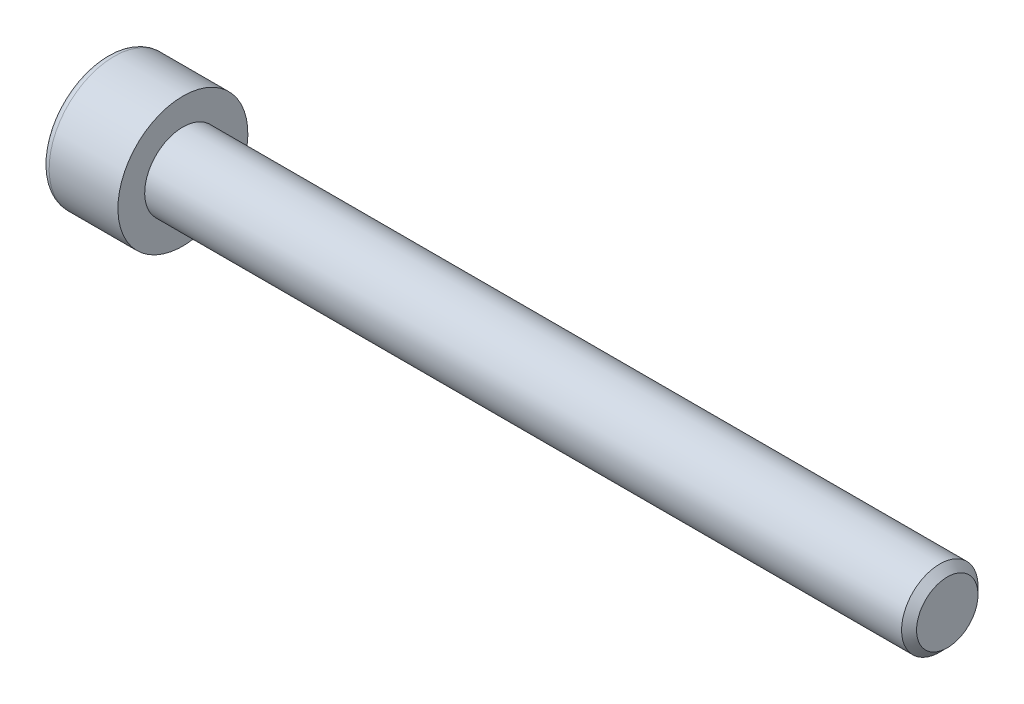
ISO-10303-21;
HEADER;
FILE_DESCRIPTION(('STEP AP214'),'2;1');
FILE_NAME('part.step','',(''),(''),'','','');
FILE_SCHEMA(('AUTOMOTIVE_DESIGN { 1 0 10303 214 1 1 1 1 }'));
ENDSEC;
DATA;
#1=APPLICATION_CONTEXT('core data for automotive mechanical design processes');
#2=APPLICATION_PROTOCOL_DEFINITION('international standard','automotive_design',2000,#1);
#3=PRODUCT_CONTEXT('',#1,'mechanical');
#4=PRODUCT('Part','Part','',(#3));
#5=PRODUCT_RELATED_PRODUCT_CATEGORY('part','',(#4));
#6=PRODUCT_DEFINITION_FORMATION('','',#4);
#7=PRODUCT_DEFINITION_CONTEXT('part definition',#1,'design');
#8=PRODUCT_DEFINITION('design','',#6,#7);
#9=PRODUCT_DEFINITION_SHAPE('','',#8);
#10=(LENGTH_UNIT() NAMED_UNIT(*) SI_UNIT(.MILLI.,.METRE.));
#11=(NAMED_UNIT(*) PLANE_ANGLE_UNIT() SI_UNIT($,.RADIAN.));
#12=(NAMED_UNIT(*) SI_UNIT($,.STERADIAN.) SOLID_ANGLE_UNIT());
#13=UNCERTAINTY_MEASURE_WITH_UNIT(LENGTH_MEASURE(1.E-05),#10,'distance_accuracy_value','');
#14=(GEOMETRIC_REPRESENTATION_CONTEXT(3) GLOBAL_UNCERTAINTY_ASSIGNED_CONTEXT((#13)) GLOBAL_UNIT_ASSIGNED_CONTEXT((#10,
#11,#12)) REPRESENTATION_CONTEXT('',''));
#15=CARTESIAN_POINT('',(0.,0.,0.));
#16=DIRECTION('',(0.,0.,1.));
#17=DIRECTION('',(1.,0.,0.));
#18=AXIS2_PLACEMENT_3D('',#15,#16,#17);
#19=CARTESIAN_POINT('',(-1.16666666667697,0.,0.));
#20=DIRECTION('',(-1.,0.,0.));
#21=DIRECTION('',(0.,0.,1.));
#22=AXIS2_PLACEMENT_3D('',#19,#20,#21);
#23=CONICAL_SURFACE('',#22,0.,1.04719755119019);
#24=CARTESIAN_POINT('',(-1.16666666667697,0.,0.));
#25=VERTEX_POINT('',#24);
#26=VERTEX_LOOP('',#25);
#27=FACE_BOUND('',#26,.T.);
#28=CARTESIAN_POINT('',(-2.50000000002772,-6.92690109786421E-12,-2.30940107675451));
#29=CARTESIAN_POINT('',(-2.47069554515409,-0.0878878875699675,-2.25865898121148));
#30=CARTESIAN_POINT('',(-2.44404467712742,-0.176534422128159,-2.20747888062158));
#31=CARTESIAN_POINT('',(-2.39752638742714,-0.355362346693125,-2.10423253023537));
#32=CARTESIAN_POINT('',(-2.37767542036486,-0.445546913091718,-2.05216444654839));
#33=CARTESIAN_POINT('',(-2.34677595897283,-0.624798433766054,-1.94867353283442));
#34=CARTESIAN_POINT('',(-2.33552178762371,-0.713837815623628,-1.89726662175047));
#35=CARTESIAN_POINT('',(-2.32208916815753,-0.892335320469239,-1.79421103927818));
#36=CARTESIAN_POINT('',(-2.3198995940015,-0.981792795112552,-1.74256274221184));
#37=CARTESIAN_POINT('',(-2.32446629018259,-1.14893448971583,-1.64606343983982));
#38=CARTESIAN_POINT('',(-2.33010128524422,-1.22664379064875,-1.60119795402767));
#39=CARTESIAN_POINT('',(-2.34795730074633,-1.38155614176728,-1.51175926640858));
#40=CARTESIAN_POINT('',(-2.36018441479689,-1.45875865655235,-1.46718637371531));
#41=CARTESIAN_POINT('',(-2.39074983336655,-1.61399014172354,-1.37756343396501));
#42=CARTESIAN_POINT('',(-2.40921764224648,-1.69199947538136,-1.33252472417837));
#43=CARTESIAN_POINT('',(-2.45113176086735,-1.84685497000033,-1.24311886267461));
#44=CARTESIAN_POINT('',(-2.47456822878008,-1.92370311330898,-1.19875056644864));
#45=CARTESIAN_POINT('',(-2.50000000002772,-1.99999999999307,-1.15470053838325));
#46=B_SPLINE_CURVE_WITH_KNOTS('',3,(#28,#29,#30,#31,#32,#33,#34,#35,#36,#37,#38,#39,#40,#41,#42,
#43,#44,#45),.UNSPECIFIED.,.F.,.F.,(4,2,2,2,2,2,2,2,4),(0.,0.317016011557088,0.634793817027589,
0.944707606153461,1.25424088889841,1.52370778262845,1.79342419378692,2.06912162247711,
2.34427797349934),.UNSPECIFIED.);
#47=CARTESIAN_POINT('',(-2.50000000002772,0.,-2.30940107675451));
#48=VERTEX_POINT('',#47);
#49=CARTESIAN_POINT('',(-2.50000000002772,-1.99999999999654,-1.15470053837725));
#50=VERTEX_POINT('',#49);
#51=EDGE_CURVE('E137',#48,#50,#46,.T.);
#52=ORIENTED_EDGE('',*,*,#51,.T.);
#53=CARTESIAN_POINT('',(-2.50000000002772,-2.,-1.15470053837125));
#54=CARTESIAN_POINT('',(-2.47263377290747,-2.,-1.05991107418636));
#55=CARTESIAN_POINT('',(-2.44757921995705,-2.,-0.964371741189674));
#56=CARTESIAN_POINT('',(-2.40329840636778,-2.,-0.771741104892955));
#57=CARTESIAN_POINT('',(-2.38408518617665,-2.,-0.674646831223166));
#58=CARTESIAN_POINT('',(-2.35318800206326,-2.,-0.481547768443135));
#59=CARTESIAN_POINT('',(-2.34133930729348,-2.,-0.385570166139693));
#60=CARTESIAN_POINT('',(-2.32543313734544,-2.,-0.193061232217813));
#61=CARTESIAN_POINT('',(-2.32136720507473,-2.,-0.0965306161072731));
#62=CARTESIAN_POINT('',(-2.32136720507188,-2.,0.0965306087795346));
#63=CARTESIAN_POINT('',(-2.32543313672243,-2.,0.193061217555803));
#64=CARTESIAN_POINT('',(-2.34133930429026,-2.,0.385570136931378));
#65=CARTESIAN_POINT('',(-2.35318799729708,-2.,0.481547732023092));
#66=CARTESIAN_POINT('',(-2.38408517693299,-2.,0.674646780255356));
#67=CARTESIAN_POINT('',(-2.40329839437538,-2.,0.771741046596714));
#68=CARTESIAN_POINT('',(-2.44757920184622,-2.,0.964371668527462));
#69=CARTESIAN_POINT('',(-2.47263375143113,-2.,1.05991099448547));
#70=CARTESIAN_POINT('',(-2.4999999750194,-2.,1.15470045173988));
#71=B_SPLINE_CURVE_WITH_KNOTS('',3,(#53,#54,#55,#56,#57,#58,#59,#60,#61,#62,#63,#64,#65,#66,#67,
#68,#69,#70),.UNSPECIFIED.,.F.,.F.,(4,2,2,2,2,2,2,2,4),(0.,0.296073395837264,0.592802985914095,
0.882630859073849,1.17214361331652,1.46165634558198,1.75148419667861,2.04821376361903,
2.34428713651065),.UNSPECIFIED.);
#72=CARTESIAN_POINT('',(-2.49999999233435,-2.00000001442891,1.15470048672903));
#73=VERTEX_POINT('',#72);
#74=EDGE_CURVE('E290',#50,#73,#71,.T.);
#75=ORIENTED_EDGE('',*,*,#74,.T.);
#76=CARTESIAN_POINT('',(-2.50000003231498,-2.00000000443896,1.15470049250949));
#77=CARTESIAN_POINT('',(-2.47069556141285,-1.91211212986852,1.20544260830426));
#78=CARTESIAN_POINT('',(-2.4440446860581,-1.82346559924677,1.25662271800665));
#79=CARTESIAN_POINT('',(-2.39752638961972,-1.64463767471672,1.35986907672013));
#80=CARTESIAN_POINT('',(-2.3776754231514,-1.55445310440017,1.41193715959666));
#81=CARTESIAN_POINT('',(-2.34677596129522,-1.37520157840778,1.51542807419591));
#82=CARTESIAN_POINT('',(-2.33552178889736,-1.28616219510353,1.56683498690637));
#83=CARTESIAN_POINT('',(-2.32208916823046,-1.10766468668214,1.66989057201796));
#84=CARTESIAN_POINT('',(-2.31989959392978,-1.01820720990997,1.72153887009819));
#85=CARTESIAN_POINT('',(-2.32446629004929,-0.851065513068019,1.81803817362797));
#86=CARTESIAN_POINT('',(-2.33010128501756,-0.773356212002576,1.86290365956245));
#87=CARTESIAN_POINT('',(-2.34795730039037,-0.61844386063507,1.95234234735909));
#88=CARTESIAN_POINT('',(-2.36018441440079,-0.541241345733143,1.9969152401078));
#89=CARTESIAN_POINT('',(-2.39074983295,-0.386009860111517,2.08653818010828));
#90=CARTESIAN_POINT('',(-2.40921764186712,-0.308000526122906,2.13157689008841));
#91=CARTESIAN_POINT('',(-2.4511317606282,-0.153145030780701,2.2209827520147));
#92=CARTESIAN_POINT('',(-2.47456822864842,-0.076296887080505,2.26535104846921));
#93=CARTESIAN_POINT('',(-2.50000000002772,-6.92562731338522E-12,2.3094010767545));
#94=B_SPLINE_CURVE_WITH_KNOTS('',3,(#76,#77,#78,#79,#80,#81,#82,#83,#84,#85,#86,#87,#88,#89,#90,
#91,#92,#93),.UNSPECIFIED.,.F.,.F.,(4,2,2,2,2,2,2,2,4),(0.,0.317016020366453,0.634793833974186,
0.944707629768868,1.25424091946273,1.5237078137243,1.79342422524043,2.06912165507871,
2.34427800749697),.UNSPECIFIED.);
#95=CARTESIAN_POINT('',(-2.50000000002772,0.,2.3094010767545));
#96=VERTEX_POINT('',#95);
#97=EDGE_CURVE('E306',#73,#96,#94,.T.);
#98=ORIENTED_EDGE('',*,*,#97,.T.);
#99=CARTESIAN_POINT('',(-2.50000000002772,6.92566095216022E-12,2.3094010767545));
#100=CARTESIAN_POINT('',(-2.47069554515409,0.0878878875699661,2.25865898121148));
#101=CARTESIAN_POINT('',(-2.44404467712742,0.176534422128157,2.20747888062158));
#102=CARTESIAN_POINT('',(-2.39752638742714,0.355362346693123,2.10423253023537));
#103=CARTESIAN_POINT('',(-2.37767542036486,0.445546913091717,2.05216444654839));
#104=CARTESIAN_POINT('',(-2.34677595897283,0.624798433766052,1.94867353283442));
#105=CARTESIAN_POINT('',(-2.33552178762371,0.713837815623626,1.89726662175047));
#106=CARTESIAN_POINT('',(-2.32208916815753,0.892335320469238,1.79421103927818));
#107=CARTESIAN_POINT('',(-2.3198995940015,0.98179279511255,1.74256274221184));
#108=CARTESIAN_POINT('',(-2.32446629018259,1.14893448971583,1.64606343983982));
#109=CARTESIAN_POINT('',(-2.33010128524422,1.22664379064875,1.60119795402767));
#110=CARTESIAN_POINT('',(-2.34795730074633,1.38155614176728,1.51175926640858));
#111=CARTESIAN_POINT('',(-2.36018441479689,1.45875865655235,1.46718637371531));
#112=CARTESIAN_POINT('',(-2.39074983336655,1.61399014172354,1.37756343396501));
#113=CARTESIAN_POINT('',(-2.40921764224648,1.69199947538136,1.33252472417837));
#114=CARTESIAN_POINT('',(-2.45113176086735,1.84685497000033,1.24311886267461));
#115=CARTESIAN_POINT('',(-2.47456822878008,1.92370311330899,1.19875056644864));
#116=CARTESIAN_POINT('',(-2.50000000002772,1.99999999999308,1.15470053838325));
#117=B_SPLINE_CURVE_WITH_KNOTS('',3,(#99,#100,#101,#102,#103,#104,#105,#106,#107,#108,#109,#110,
#111,#112,#113,#114,#115,#116),.UNSPECIFIED.,.F.,.F.,(4,2,2,2,2,2,2,2,4),(0.,0.317016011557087,
0.634793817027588,0.94470760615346,1.25424088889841,1.52370778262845,1.79342419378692,
2.06912162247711,2.34427797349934),.UNSPECIFIED.);
#118=CARTESIAN_POINT('',(-2.50000000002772,1.99999999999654,1.15470053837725));
#119=VERTEX_POINT('',#118);
#120=EDGE_CURVE('E311',#96,#119,#117,.T.);
#121=ORIENTED_EDGE('',*,*,#120,.T.);
#122=CARTESIAN_POINT('',(-2.50000000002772,2.,1.15470053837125));
#123=CARTESIAN_POINT('',(-2.47263377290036,2.,1.05991107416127));
#124=CARTESIAN_POINT('',(-2.44757921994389,2.,0.964371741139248));
#125=CARTESIAN_POINT('',(-2.40329840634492,2.,0.771741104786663));
#126=CARTESIAN_POINT('',(-2.38408518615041,2.,0.674646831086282));
#127=CARTESIAN_POINT('',(-2.35318800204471,2.,0.481547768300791));
#128=CARTESIAN_POINT('',(-2.34133930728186,2.,0.385570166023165));
#129=CARTESIAN_POINT('',(-2.32543313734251,2.,0.193061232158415));
#130=CARTESIAN_POINT('',(-2.32136720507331,2.,0.0965306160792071));
#131=CARTESIAN_POINT('',(-2.32136720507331,2.,-0.0965306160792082));
#132=CARTESIAN_POINT('',(-2.32543313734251,2.,-0.193061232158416));
#133=CARTESIAN_POINT('',(-2.34133930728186,2.,-0.385570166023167));
#134=CARTESIAN_POINT('',(-2.35318800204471,2.,-0.481547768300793));
#135=CARTESIAN_POINT('',(-2.38408518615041,2.,-0.674646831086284));
#136=CARTESIAN_POINT('',(-2.40329840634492,2.,-0.771741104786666));
#137=CARTESIAN_POINT('',(-2.44757921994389,2.,-0.964371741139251));
#138=CARTESIAN_POINT('',(-2.47263377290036,2.,-1.05991107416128));
#139=CARTESIAN_POINT('',(-2.50000000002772,2.,-1.15470053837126));
#140=B_SPLINE_CURVE_WITH_KNOTS('',3,(#122,#123,#124,#125,#126,#127,#128,#129,#130,#131,#132,
#133,#134,#135,#136,#137,#138,#139),.UNSPECIFIED.,.F.,.F.,(4,2,2,2,2,2,2,2,4),(0.,
0.296073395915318,0.592802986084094,0.882630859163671,1.17214361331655,1.46165636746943,
1.75148424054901,2.04821383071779,2.3442872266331),.UNSPECIFIED.);
#141=CARTESIAN_POINT('',(-2.50000000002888,2.,-1.15470053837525));
#142=VERTEX_POINT('',#141);
#143=EDGE_CURVE('E20',#119,#142,#140,.T.);
#144=ORIENTED_EDGE('',*,*,#143,.T.);
#145=CARTESIAN_POINT('',(-2.50000000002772,1.99999999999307,-1.15470053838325));
#146=CARTESIAN_POINT('',(-2.47069554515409,1.91211211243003,-1.20544263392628));
#147=CARTESIAN_POINT('',(-2.44404467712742,1.82346557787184,-1.25662273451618));
#148=CARTESIAN_POINT('',(-2.39752638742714,1.64463765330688,-1.35986908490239));
#149=CARTESIAN_POINT('',(-2.37767542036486,1.55445308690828,-1.41193716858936));
#150=CARTESIAN_POINT('',(-2.34677595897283,1.37520156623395,-1.51542808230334));
#151=CARTESIAN_POINT('',(-2.33552178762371,1.28616218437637,-1.56683499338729));
#152=CARTESIAN_POINT('',(-2.32208916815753,1.10766467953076,-1.66989057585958));
#153=CARTESIAN_POINT('',(-2.3198995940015,1.01820720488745,-1.72153887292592));
#154=CARTESIAN_POINT('',(-2.32446629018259,0.851065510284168,-1.81803817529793));
#155=CARTESIAN_POINT('',(-2.33010128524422,0.773356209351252,-1.86290366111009));
#156=CARTESIAN_POINT('',(-2.34795730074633,0.618443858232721,-1.95234234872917));
#157=CARTESIAN_POINT('',(-2.36018441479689,0.541241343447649,-1.99691524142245));
#158=CARTESIAN_POINT('',(-2.39074983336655,0.386009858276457,-2.08653818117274));
#159=CARTESIAN_POINT('',(-2.40921764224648,0.308000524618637,-2.13157689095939));
#160=CARTESIAN_POINT('',(-2.45113176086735,0.153145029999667,-2.22098275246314));
#161=CARTESIAN_POINT('',(-2.47456822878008,0.0762968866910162,-2.26535104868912));
#162=CARTESIAN_POINT('',(-2.50000000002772,6.92553144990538E-12,-2.30940107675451));
#163=B_SPLINE_CURVE_WITH_KNOTS('',3,(#145,#146,#147,#148,#149,#150,#151,#152,#153,#154,#155,
#156,#157,#158,#159,#160,#161,#162),.UNSPECIFIED.,.F.,.F.,(4,2,2,2,2,2,2,2,4),(0.,
0.317016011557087,0.634793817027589,0.94470760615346,1.25424088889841,1.52370778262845,
1.79342419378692,2.06912162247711,2.34427797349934),.UNSPECIFIED.);
#164=EDGE_CURVE('E90',#142,#48,#163,.T.);
#165=ORIENTED_EDGE('',*,*,#164,.T.);
#166=EDGE_LOOP('',(#52,#75,#98,#121,#144,#165));
#167=FACE_BOUND('',#166,.T.);
#168=ADVANCED_FACE('F16',(#27,#167),#23,.F.);
#169=CARTESIAN_POINT('',(-5.,2.,1.15470053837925));
#170=DIRECTION('',(0.,1.,0.));
#171=DIRECTION('',(0.,0.,1.));
#172=AXIS2_PLACEMENT_3D('',#169,#170,#171);
#173=PLANE('',#172);
#174=DIRECTION('',(1.,0.,0.));
#175=VECTOR('',#174,1.);
#176=CARTESIAN_POINT('',(-5.,2.,1.15470053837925));
#177=LINE('',#176,#175);
#178=CARTESIAN_POINT('',(-5.,2.,1.15470053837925));
#179=VERTEX_POINT('',#178);
#180=EDGE_CURVE('E84',#119,#179,#177,.F.);
#181=ORIENTED_EDGE('',*,*,#180,.T.);
#182=DIRECTION('',(0.,0.,1.));
#183=VECTOR('',#182,1.);
#184=CARTESIAN_POINT('',(-5.,2.,0.));
#185=LINE('',#184,#183);
#186=CARTESIAN_POINT('',(-5.,2.,-1.15470053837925));
#187=VERTEX_POINT('',#186);
#188=EDGE_CURVE('E78',#187,#179,#185,.T.);
#189=ORIENTED_EDGE('',*,*,#188,.F.);
#190=DIRECTION('',(1.,0.,0.));
#191=VECTOR('',#190,1.);
#192=CARTESIAN_POINT('',(-5.,2.,-1.15470053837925));
#193=LINE('',#192,#191);
#194=EDGE_CURVE('E81',#187,#142,#193,.T.);
#195=ORIENTED_EDGE('',*,*,#194,.T.);
#196=ORIENTED_EDGE('',*,*,#143,.F.);
#197=EDGE_LOOP('',(#181,#189,#195,#196));
#198=FACE_BOUND('',#197,.T.);
#199=ADVANCED_FACE('F80',(#198),#173,.F.);
#200=CARTESIAN_POINT('',(-5.,0.,2.3094010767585));
#201=DIRECTION('',(0.,0.5,0.866025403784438));
#202=DIRECTION('',(0.,-0.866025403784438,0.5));
#203=AXIS2_PLACEMENT_3D('',#200,#201,#202);
#204=PLANE('',#203);
#205=DIRECTION('',(1.,0.,0.));
#206=VECTOR('',#205,1.);
#207=CARTESIAN_POINT('',(-5.,0.,2.3094010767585));
#208=LINE('',#207,#206);
#209=CARTESIAN_POINT('',(-5.,0.,2.3094010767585));
#210=VERTEX_POINT('',#209);
#211=EDGE_CURVE('E309',#96,#210,#208,.F.);
#212=ORIENTED_EDGE('',*,*,#211,.T.);
#213=DIRECTION('',(0.,-0.866025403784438,0.5));
#214=VECTOR('',#213,1.);
#215=CARTESIAN_POINT('',(-5.,2.,1.15470053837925));
#216=LINE('',#215,#214);
#217=EDGE_CURVE('E89',#179,#210,#216,.T.);
#218=ORIENTED_EDGE('',*,*,#217,.F.);
#219=ORIENTED_EDGE('',*,*,#180,.F.);
#220=ORIENTED_EDGE('',*,*,#120,.F.);
#221=EDGE_LOOP('',(#212,#218,#219,#220));
#222=FACE_BOUND('',#221,.T.);
#223=ADVANCED_FACE('F265',(#222),#204,.F.);
#224=CARTESIAN_POINT('',(-5.,-2.,1.15470053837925));
#225=DIRECTION('',(0.,-0.5,0.866025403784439));
#226=DIRECTION('',(0.,-0.866025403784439,-0.5));
#227=AXIS2_PLACEMENT_3D('',#224,#225,#226);
#228=PLANE('',#227);
#229=DIRECTION('',(1.,0.,0.));
#230=VECTOR('',#229,1.);
#231=CARTESIAN_POINT('',(-5.,-2.,1.15470053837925));
#232=LINE('',#231,#230);
#233=CARTESIAN_POINT('',(-5.,-2.,1.15470053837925));
#234=VERTEX_POINT('',#233);
#235=EDGE_CURVE('E295',#73,#234,#232,.F.);
#236=ORIENTED_EDGE('',*,*,#235,.T.);
#237=DIRECTION('',(0.,-0.866025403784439,-0.5));
#238=VECTOR('',#237,1.);
#239=CARTESIAN_POINT('',(-5.,0.,2.3094010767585));
#240=LINE('',#239,#238);
#241=EDGE_CURVE('E114',#210,#234,#240,.T.);
#242=ORIENTED_EDGE('',*,*,#241,.F.);
#243=ORIENTED_EDGE('',*,*,#211,.F.);
#244=ORIENTED_EDGE('',*,*,#97,.F.);
#245=EDGE_LOOP('',(#236,#242,#243,#244));
#246=FACE_BOUND('',#245,.T.);
#247=ADVANCED_FACE('F258',(#246),#228,.F.);
#248=CARTESIAN_POINT('',(-5.,-2.,-1.15470053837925));
#249=DIRECTION('',(0.,-1.,0.));
#250=DIRECTION('',(0.,0.,-1.));
#251=AXIS2_PLACEMENT_3D('',#248,#249,#250);
#252=PLANE('',#251);
#253=DIRECTION('',(1.,0.,0.));
#254=VECTOR('',#253,1.);
#255=CARTESIAN_POINT('',(-5.,-2.,-1.15470053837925));
#256=LINE('',#255,#254);
#257=CARTESIAN_POINT('',(-5.,-2.,-1.15470053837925));
#258=VERTEX_POINT('',#257);
#259=EDGE_CURVE('E292',#50,#258,#256,.F.);
#260=ORIENTED_EDGE('',*,*,#259,.T.);
#261=DIRECTION('',(0.,0.,1.));
#262=VECTOR('',#261,1.);
#263=CARTESIAN_POINT('',(-5.,-2.,0.));
#264=LINE('',#263,#262);
#265=EDGE_CURVE('E104',#234,#258,#264,.F.);
#266=ORIENTED_EDGE('',*,*,#265,.F.);
#267=ORIENTED_EDGE('',*,*,#235,.F.);
#268=ORIENTED_EDGE('',*,*,#74,.F.);
#269=EDGE_LOOP('',(#260,#266,#267,#268));
#270=FACE_BOUND('',#269,.T.);
#271=ADVANCED_FACE('F252',(#270),#252,.F.);
#272=CARTESIAN_POINT('',(-5.,0.,-2.3094010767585));
#273=DIRECTION('',(0.,-0.5,-0.866025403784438));
#274=DIRECTION('',(0.,0.866025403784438,-0.5));
#275=AXIS2_PLACEMENT_3D('',#272,#273,#274);
#276=PLANE('',#275);
#277=DIRECTION('',(1.,0.,0.));
#278=VECTOR('',#277,1.);
#279=CARTESIAN_POINT('',(-5.,0.,-2.3094010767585));
#280=LINE('',#279,#278);
#281=CARTESIAN_POINT('',(-5.,0.,-2.3094010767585));
#282=VERTEX_POINT('',#281);
#283=EDGE_CURVE('E40',#48,#282,#280,.F.);
#284=ORIENTED_EDGE('',*,*,#283,.T.);
#285=DIRECTION('',(0.,0.866025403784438,-0.500000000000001));
#286=VECTOR('',#285,1.);
#287=CARTESIAN_POINT('',(-5.,-2.,-1.15470053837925));
#288=LINE('',#287,#286);
#289=EDGE_CURVE('E99',#258,#282,#288,.T.);
#290=ORIENTED_EDGE('',*,*,#289,.F.);
#291=ORIENTED_EDGE('',*,*,#259,.F.);
#292=ORIENTED_EDGE('',*,*,#51,.F.);
#293=EDGE_LOOP('',(#284,#290,#291,#292));
#294=FACE_BOUND('',#293,.T.);
#295=ADVANCED_FACE('F147',(#294),#276,.F.);
#296=CARTESIAN_POINT('',(-5.,2.,-1.15470053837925));
#297=DIRECTION('',(0.,0.5,-0.866025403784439));
#298=DIRECTION('',(0.,0.866025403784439,0.5));
#299=AXIS2_PLACEMENT_3D('',#296,#297,#298);
#300=PLANE('',#299);
#301=ORIENTED_EDGE('',*,*,#194,.F.);
#302=DIRECTION('',(0.,0.866025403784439,0.5));
#303=VECTOR('',#302,1.);
#304=CARTESIAN_POINT('',(-5.,0.,-2.3094010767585));
#305=LINE('',#304,#303);
#306=EDGE_CURVE('E94',#282,#187,#305,.T.);
#307=ORIENTED_EDGE('',*,*,#306,.F.);
#308=ORIENTED_EDGE('',*,*,#283,.F.);
#309=ORIENTED_EDGE('',*,*,#164,.F.);
#310=EDGE_LOOP('',(#301,#307,#308,#309));
#311=FACE_BOUND('',#310,.T.);
#312=ADVANCED_FACE('F93',(#311),#300,.F.);
#313=CARTESIAN_POINT('',(-5.,3.27970053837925,0.));
#314=DIRECTION('',(-1.,0.,0.));
#315=DIRECTION('',(0.,-1.,0.));
#316=AXIS2_PLACEMENT_3D('',#313,#314,#315);
#317=PLANE('',#316);
#318=CARTESIAN_POINT('',(-5.,0.,0.));
#319=DIRECTION('',(1.,0.,0.));
#320=DIRECTION('',(0.,1.,0.));
#321=AXIS2_PLACEMENT_3D('',#318,#319,#320);
#322=CIRCLE('',#321,3.75);
#323=CARTESIAN_POINT('',(-5.,3.75,0.));
#324=VERTEX_POINT('',#323);
#325=EDGE_CURVE('E100',#324,#324,#322,.T.);
#326=ORIENTED_EDGE('',*,*,#325,.F.);
#327=EDGE_LOOP('',(#326));
#328=FACE_BOUND('',#327,.T.);
#329=ORIENTED_EDGE('',*,*,#289,.T.);
#330=ORIENTED_EDGE('',*,*,#306,.T.);
#331=ORIENTED_EDGE('',*,*,#188,.T.);
#332=ORIENTED_EDGE('',*,*,#217,.T.);
#333=ORIENTED_EDGE('',*,*,#241,.T.);
#334=ORIENTED_EDGE('',*,*,#265,.T.);
#335=EDGE_LOOP('',(#329,#330,#331,#332,#333,#334));
#336=FACE_BOUND('',#335,.T.);
#337=ADVANCED_FACE('F97',(#328,#336),#317,.T.);
#338=CARTESIAN_POINT('',(-4.5,0.,0.));
#339=DIRECTION('',(1.,0.,0.));
#340=DIRECTION('',(0.,0.,-1.));
#341=AXIS2_PLACEMENT_3D('',#338,#339,#340);
#342=TOROIDAL_SURFACE('',#341,3.75,0.5);
#343=CARTESIAN_POINT('',(-4.5,0.,0.));
#344=DIRECTION('',(1.,0.,0.));
#345=DIRECTION('',(0.,1.,0.));
#346=AXIS2_PLACEMENT_3D('',#343,#344,#345);
#347=CIRCLE('',#346,4.25);
#348=CARTESIAN_POINT('',(-4.5,4.25,0.));
#349=VERTEX_POINT('',#348);
#350=EDGE_CURVE('E103',#349,#349,#347,.T.);
#351=ORIENTED_EDGE('',*,*,#350,.F.);
#352=EDGE_LOOP('',(#351));
#353=FACE_BOUND('',#352,.T.);
#354=ORIENTED_EDGE('',*,*,#325,.T.);
#355=EDGE_LOOP('',(#354));
#356=FACE_BOUND('',#355,.T.);
#357=ADVANCED_FACE('F153',(#353,#356),#342,.T.);
#358=CARTESIAN_POINT('',(-2.5,0.,0.));
#359=DIRECTION('',(1.,0.,0.));
#360=DIRECTION('',(0.,1.,0.));
#361=AXIS2_PLACEMENT_3D('',#358,#359,#360);
#362=CYLINDRICAL_SURFACE('',#361,4.25);
#363=CARTESIAN_POINT('',(0.,0.,0.));
#364=DIRECTION('',(1.,0.,0.));
#365=DIRECTION('',(0.,1.,0.));
#366=AXIS2_PLACEMENT_3D('',#363,#364,#365);
#367=CIRCLE('',#366,4.25);
#368=CARTESIAN_POINT('',(0.,4.25,0.));
#369=VERTEX_POINT('',#368);
#370=EDGE_CURVE('E129',#369,#369,#367,.T.);
#371=ORIENTED_EDGE('',*,*,#370,.F.);
#372=EDGE_LOOP('',(#371));
#373=FACE_BOUND('',#372,.T.);
#374=ORIENTED_EDGE('',*,*,#350,.T.);
#375=EDGE_LOOP('',(#374));
#376=FACE_BOUND('',#375,.T.);
#377=ADVANCED_FACE('F183',(#373,#376),#362,.T.);
#378=CARTESIAN_POINT('',(50.,1.25,0.));
#379=DIRECTION('',(1.,0.,0.));
#380=DIRECTION('',(0.,0.,-1.));
#381=AXIS2_PLACEMENT_3D('',#378,#379,#380);
#382=PLANE('',#381);
#383=CARTESIAN_POINT('',(49.9999999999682,0.,0.));
#384=DIRECTION('',(-1.,0.,0.));
#385=DIRECTION('',(0.,0.,1.));
#386=AXIS2_PLACEMENT_3D('',#383,#384,#385);
#387=CIRCLE('',#386,2.00923999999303);
#388=CARTESIAN_POINT('',(49.9999999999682,0.,2.00923999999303));
#389=VERTEX_POINT('',#388);
#390=EDGE_CURVE('E126',#389,#389,#387,.T.);
#391=ORIENTED_EDGE('',*,*,#390,.F.);
#392=EDGE_LOOP('',(#391));
#393=FACE_BOUND('',#392,.T.);
#394=ADVANCED_FACE('F189',(#393),#382,.T.);
#395=CARTESIAN_POINT('',(0.,3.375,0.));
#396=DIRECTION('',(1.,0.,0.));
#397=DIRECTION('',(0.,0.,-1.));
#398=AXIS2_PLACEMENT_3D('',#395,#396,#397);
#399=PLANE('',#398);
#400=ORIENTED_EDGE('',*,*,#370,.T.);
#401=EDGE_LOOP('',(#400));
#402=FACE_BOUND('',#401,.T.);
#403=CARTESIAN_POINT('',(0.,0.,0.));
#404=DIRECTION('',(1.,0.,0.));
#405=DIRECTION('',(0.,1.,0.));
#406=AXIS2_PLACEMENT_3D('',#403,#404,#405);
#407=CIRCLE('',#406,2.5);
#408=CARTESIAN_POINT('',(0.,2.5,0.));
#409=VERTEX_POINT('',#408);
#410=EDGE_CURVE('E31',#409,#409,#407,.T.);
#411=ORIENTED_EDGE('',*,*,#410,.F.);
#412=EDGE_LOOP('',(#411));
#413=FACE_BOUND('',#412,.T.);
#414=ADVANCED_FACE('F198',(#402,#413),#399,.T.);
#415=CARTESIAN_POINT('',(49.5092400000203,0.,0.));
#416=DIRECTION('',(-1.,0.,0.));
#417=DIRECTION('',(0.,0.,1.));
#418=AXIS2_PLACEMENT_3D('',#415,#416,#417);
#419=CONICAL_SURFACE('',#418,2.49999999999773,0.785398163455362);
#420=CARTESIAN_POINT('',(49.50924,0.,0.));
#421=DIRECTION('',(1.,0.,0.));
#422=DIRECTION('',(0.,1.,0.));
#423=AXIS2_PLACEMENT_3D('',#420,#421,#422);
#424=CIRCLE('',#423,2.5);
#425=CARTESIAN_POINT('',(49.50924,2.5,0.));
#426=VERTEX_POINT('',#425);
#427=EDGE_CURVE('E10',#426,#426,#424,.F.);
#428=ORIENTED_EDGE('',*,*,#427,.F.);
#429=EDGE_LOOP('',(#428));
#430=FACE_BOUND('',#429,.T.);
#431=ORIENTED_EDGE('',*,*,#390,.T.);
#432=EDGE_LOOP('',(#431));
#433=FACE_BOUND('',#432,.T.);
#434=ADVANCED_FACE('F193',(#430,#433),#419,.T.);
#435=CARTESIAN_POINT('',(39.,0.,0.));
#436=DIRECTION('',(1.,0.,0.));
#437=DIRECTION('',(0.,1.,0.));
#438=AXIS2_PLACEMENT_3D('',#435,#436,#437);
#439=CYLINDRICAL_SURFACE('',#438,2.5);
#440=ORIENTED_EDGE('',*,*,#410,.T.);
#441=EDGE_LOOP('',(#440));
#442=FACE_BOUND('',#441,.T.);
#443=ORIENTED_EDGE('',*,*,#427,.T.);
#444=EDGE_LOOP('',(#443));
#445=FACE_BOUND('',#444,.T.);
#446=ADVANCED_FACE('F18',(#442,#445),#439,.T.);
#447=CLOSED_SHELL('',(#168,#199,#223,#247,#271,#295,#312,#337,#357,#377,#394,#414,#434,#446));
#448=MANIFOLD_SOLID_BREP('B1',#447);
#449=ADVANCED_BREP_SHAPE_REPRESENTATION('',(#18,#448),#14);
#450=SHAPE_DEFINITION_REPRESENTATION(#9,#449);
ENDSEC;
END-ISO-10303-21;
